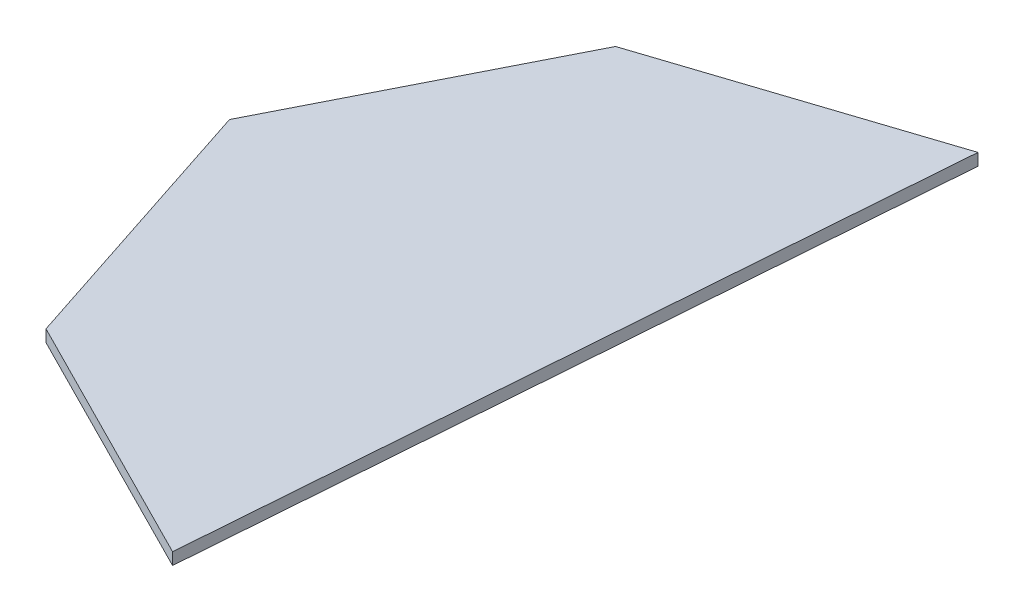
from build123d import *

# Parameters (mm, degrees)
BOSS_EXTRUDE1_DEPTH = 12


with BuildPart() as part:
    # Sketch1 → Boss-Extrude1 (new body)
    with BuildSketch(Plane(origin=(0, 0, 0), x_dir=(1, 0, 0), z_dir=(0, 1, 0))):
        Polygon((28.514350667, 375), (-28.514350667, -375), (-285.327733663, -245.002352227), (-375, 28.514350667), (-245.002352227, 285.327733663), align=None)
    extrude(amount=BOSS_EXTRUDE1_DEPTH)


solid = part.part
